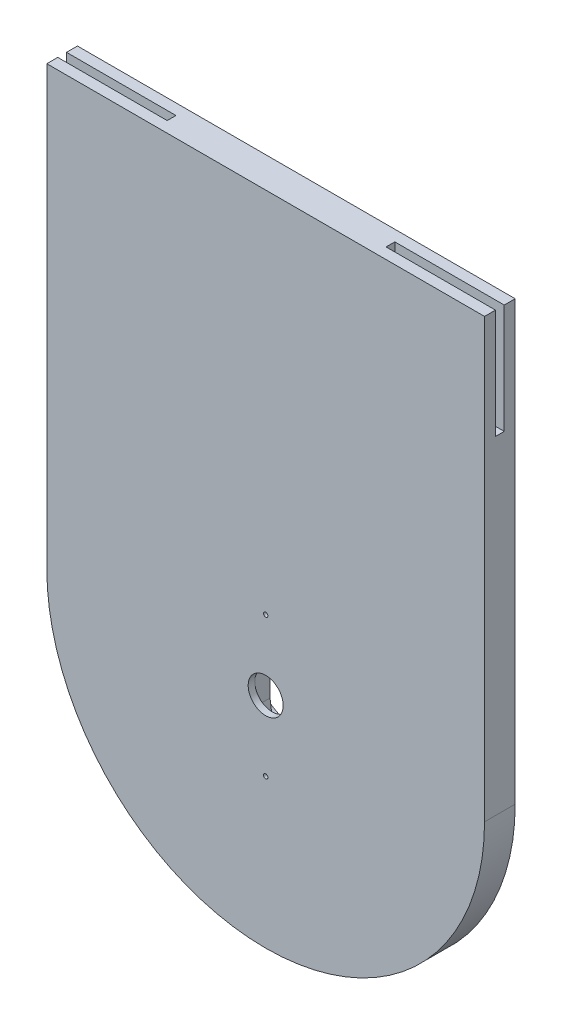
ISO-10303-21;
HEADER;
FILE_DESCRIPTION(('STEP AP214'),'2;1');
FILE_NAME('part.step','',(''),(''),'','','');
FILE_SCHEMA(('AUTOMOTIVE_DESIGN { 1 0 10303 214 1 1 1 1 }'));
ENDSEC;
DATA;
#1=APPLICATION_CONTEXT('core data for automotive mechanical design processes');
#2=APPLICATION_PROTOCOL_DEFINITION('international standard','automotive_design',2000,#1);
#3=PRODUCT_CONTEXT('',#1,'mechanical');
#4=PRODUCT('Part','Part','',(#3));
#5=PRODUCT_RELATED_PRODUCT_CATEGORY('part','',(#4));
#6=PRODUCT_DEFINITION_FORMATION('','',#4);
#7=PRODUCT_DEFINITION_CONTEXT('part definition',#1,'design');
#8=PRODUCT_DEFINITION('design','',#6,#7);
#9=PRODUCT_DEFINITION_SHAPE('','',#8);
#10=(LENGTH_UNIT() NAMED_UNIT(*) SI_UNIT(.MILLI.,.METRE.));
#11=(NAMED_UNIT(*) PLANE_ANGLE_UNIT() SI_UNIT($,.RADIAN.));
#12=(NAMED_UNIT(*) SI_UNIT($,.STERADIAN.) SOLID_ANGLE_UNIT());
#13=UNCERTAINTY_MEASURE_WITH_UNIT(LENGTH_MEASURE(1.E-05),#10,'distance_accuracy_value','');
#14=(GEOMETRIC_REPRESENTATION_CONTEXT(3) GLOBAL_UNCERTAINTY_ASSIGNED_CONTEXT((#13)) GLOBAL_UNIT_ASSIGNED_CONTEXT((#10,
#11,#12)) REPRESENTATION_CONTEXT('',''));
#15=CARTESIAN_POINT('',(0.,0.,0.));
#16=DIRECTION('',(0.,0.,1.));
#17=DIRECTION('',(1.,0.,0.));
#18=AXIS2_PLACEMENT_3D('',#15,#16,#17);
#19=CARTESIAN_POINT('',(0.,0.,0.));
#20=DIRECTION('',(0.,-1.,0.));
#21=DIRECTION('',(0.,0.,-1.));
#22=AXIS2_PLACEMENT_3D('',#19,#20,#21);
#23=PLANE('',#22);
#24=DIRECTION('',(0.,0.,-1.));
#25=VECTOR('',#24,1.);
#26=CARTESIAN_POINT('',(0.,0.,88.));
#27=LINE('',#26,#25);
#28=CARTESIAN_POINT('',(0.,0.,83.5));
#29=VERTEX_POINT('',#28);
#30=CARTESIAN_POINT('',(0.,0.,81.));
#31=VERTEX_POINT('',#30);
#32=EDGE_CURVE('E46',#29,#31,#27,.T.);
#33=ORIENTED_EDGE('',*,*,#32,.F.);
#34=DIRECTION('',(-1.,0.,0.));
#35=VECTOR('',#34,1.);
#36=CARTESIAN_POINT('',(0.,0.,83.5));
#37=LINE('',#36,#35);
#38=CARTESIAN_POINT('',(25.,0.,83.5));
#39=VERTEX_POINT('',#38);
#40=EDGE_CURVE('E225',#39,#29,#37,.T.);
#41=ORIENTED_EDGE('',*,*,#40,.F.);
#42=DIRECTION('',(0.,0.,-1.));
#43=VECTOR('',#42,1.);
#44=CARTESIAN_POINT('',(25.,0.,83.5));
#45=LINE('',#44,#43);
#46=CARTESIAN_POINT('',(25.,0.,85.5));
#47=VERTEX_POINT('',#46);
#48=EDGE_CURVE('E683',#47,#39,#45,.T.);
#49=ORIENTED_EDGE('',*,*,#48,.F.);
#50=DIRECTION('',(1.,0.,0.));
#51=VECTOR('',#50,1.);
#52=CARTESIAN_POINT('',(0.,0.,85.5));
#53=LINE('',#52,#51);
#54=CARTESIAN_POINT('',(0.,0.,85.5));
#55=VERTEX_POINT('',#54);
#56=EDGE_CURVE('E267',#55,#47,#53,.T.);
#57=ORIENTED_EDGE('',*,*,#56,.F.);
#58=CARTESIAN_POINT('',(0.,0.,88.));
#59=VERTEX_POINT('',#58);
#60=EDGE_CURVE('E11',#59,#55,#27,.T.);
#61=ORIENTED_EDGE('',*,*,#60,.F.);
#62=DIRECTION('',(-1.,0.,0.));
#63=VECTOR('',#62,1.);
#64=CARTESIAN_POINT('',(0.,0.,88.));
#65=LINE('',#64,#63);
#66=CARTESIAN_POINT('',(100.,0.,88.));
#67=VERTEX_POINT('',#66);
#68=EDGE_CURVE('E481',#67,#59,#65,.T.);
#69=ORIENTED_EDGE('',*,*,#68,.F.);
#70=DIRECTION('',(0.,0.,1.));
#71=VECTOR('',#70,1.);
#72=CARTESIAN_POINT('',(100.,0.,88.));
#73=LINE('',#72,#71);
#74=CARTESIAN_POINT('',(100.,0.,85.5));
#75=VERTEX_POINT('',#74);
#76=EDGE_CURVE('E489',#75,#67,#73,.T.);
#77=ORIENTED_EDGE('',*,*,#76,.F.);
#78=DIRECTION('',(1.,0.,0.));
#79=VECTOR('',#78,1.);
#80=CARTESIAN_POINT('',(100.,0.,85.5));
#81=LINE('',#80,#79);
#82=CARTESIAN_POINT('',(75.,0.,85.5));
#83=VERTEX_POINT('',#82);
#84=EDGE_CURVE('E243',#83,#75,#81,.T.);
#85=ORIENTED_EDGE('',*,*,#84,.F.);
#86=DIRECTION('',(0.,0.,1.));
#87=VECTOR('',#86,1.);
#88=CARTESIAN_POINT('',(75.,0.,85.5));
#89=LINE('',#88,#87);
#90=CARTESIAN_POINT('',(75.,0.,83.5));
#91=VERTEX_POINT('',#90);
#92=EDGE_CURVE('E257',#91,#83,#89,.T.);
#93=ORIENTED_EDGE('',*,*,#92,.F.);
#94=DIRECTION('',(-1.,0.,0.));
#95=VECTOR('',#94,1.);
#96=CARTESIAN_POINT('',(100.,0.,83.5));
#97=LINE('',#96,#95);
#98=CARTESIAN_POINT('',(100.,0.,83.5));
#99=VERTEX_POINT('',#98);
#100=EDGE_CURVE('E253',#99,#91,#97,.T.);
#101=ORIENTED_EDGE('',*,*,#100,.F.);
#102=CARTESIAN_POINT('',(100.,0.,81.));
#103=VERTEX_POINT('',#102);
#104=EDGE_CURVE('E486',#103,#99,#73,.T.);
#105=ORIENTED_EDGE('',*,*,#104,.F.);
#106=DIRECTION('',(1.,0.,0.));
#107=VECTOR('',#106,1.);
#108=CARTESIAN_POINT('',(0.,0.,81.));
#109=LINE('',#108,#107);
#110=EDGE_CURVE('E415',#31,#103,#109,.T.);
#111=ORIENTED_EDGE('',*,*,#110,.F.);
#112=EDGE_LOOP('',(#33,#41,#49,#57,#61,#69,#77,#85,#93,#101,#105,#111));
#113=FACE_BOUND('',#112,.T.);
#114=ADVANCED_FACE('F38',(#113),#23,.F.);
#115=CARTESIAN_POINT('',(0.,-100.,81.));
#116=DIRECTION('',(0.,0.,1.));
#117=DIRECTION('',(1.,0.,0.));
#118=AXIS2_PLACEMENT_3D('',#115,#116,#117);
#119=PLANE('',#118);
#120=DIRECTION('',(0.135113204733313,-0.990830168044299,0.));
#121=VECTOR('',#120,1.);
#122=CARTESIAN_POINT('',(46.,-105.,81.));
#123=LINE('',#122,#121);
#124=CARTESIAN_POINT('',(46.6006102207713,-109.404474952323,81.));
#125=VERTEX_POINT('',#124);
#126=CARTESIAN_POINT('',(47.5,-116.,81.));
#127=VERTEX_POINT('',#126);
#128=EDGE_CURVE('E352',#125,#127,#123,.T.);
#129=ORIENTED_EDGE('',*,*,#128,.T.);
#130=CARTESIAN_POINT('',(50.,-116.,81.));
#131=DIRECTION('',(0.,0.,1.));
#132=DIRECTION('',(1.,0.,0.));
#133=AXIS2_PLACEMENT_3D('',#130,#131,#132);
#134=CIRCLE('',#133,2.5);
#135=CARTESIAN_POINT('',(52.5,-116.,81.));
#136=VERTEX_POINT('',#135);
#137=EDGE_CURVE('E348',#127,#136,#134,.T.);
#138=ORIENTED_EDGE('',*,*,#137,.T.);
#139=DIRECTION('',(-0.135113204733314,-0.990830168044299,0.));
#140=VECTOR('',#139,1.);
#141=CARTESIAN_POINT('',(54.,-105.,81.));
#142=LINE('',#141,#140);
#143=CARTESIAN_POINT('',(53.3993897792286,-109.404474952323,81.));
#144=VERTEX_POINT('',#143);
#145=EDGE_CURVE('E345',#144,#136,#142,.T.);
#146=ORIENTED_EDGE('',*,*,#145,.F.);
#147=CARTESIAN_POINT('',(50.,-100.,81.));
#148=DIRECTION('',(0.,0.,-1.));
#149=DIRECTION('',(-1.,0.,0.));
#150=AXIS2_PLACEMENT_3D('',#147,#148,#149);
#151=CIRCLE('',#150,10.);
#152=CARTESIAN_POINT('',(53.3993897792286,-90.5955250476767,81.));
#153=VERTEX_POINT('',#152);
#154=EDGE_CURVE('E407',#153,#144,#151,.T.);
#155=ORIENTED_EDGE('',*,*,#154,.F.);
#156=DIRECTION('',(0.135113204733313,-0.990830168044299,0.));
#157=VECTOR('',#156,1.);
#158=CARTESIAN_POINT('',(52.5,-84.,81.));
#159=LINE('',#158,#157);
#160=CARTESIAN_POINT('',(52.5,-84.,81.));
#161=VERTEX_POINT('',#160);
#162=EDGE_CURVE('E342',#161,#153,#159,.T.);
#163=ORIENTED_EDGE('',*,*,#162,.F.);
#164=CARTESIAN_POINT('',(50.,-84.,81.));
#165=DIRECTION('',(0.,0.,-1.));
#166=DIRECTION('',(-1.,0.,0.));
#167=AXIS2_PLACEMENT_3D('',#164,#165,#166);
#168=CIRCLE('',#167,2.5);
#169=CARTESIAN_POINT('',(47.5,-84.,81.));
#170=VERTEX_POINT('',#169);
#171=EDGE_CURVE('E304',#170,#161,#168,.T.);
#172=ORIENTED_EDGE('',*,*,#171,.F.);
#173=DIRECTION('',(-0.135113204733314,-0.990830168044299,0.));
#174=VECTOR('',#173,1.);
#175=CARTESIAN_POINT('',(47.5,-84.,81.));
#176=LINE('',#175,#174);
#177=CARTESIAN_POINT('',(46.6006102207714,-90.5955250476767,81.));
#178=VERTEX_POINT('',#177);
#179=EDGE_CURVE('E310',#170,#178,#176,.T.);
#180=ORIENTED_EDGE('',*,*,#179,.T.);
#181=EDGE_CURVE('E401',#125,#178,#151,.T.);
#182=ORIENTED_EDGE('',*,*,#181,.F.);
#183=EDGE_LOOP('',(#129,#138,#146,#155,#163,#172,#180,#182));
#184=FACE_BOUND('',#183,.T.);
#185=CARTESIAN_POINT('',(50.,-100.,81.));
#186=DIRECTION('',(0.,0.,-1.));
#187=DIRECTION('',(-1.,0.,0.));
#188=AXIS2_PLACEMENT_3D('',#185,#186,#187);
#189=CIRCLE('',#188,32.);
#190=CARTESIAN_POINT('',(18.,-100.,81.));
#191=VERTEX_POINT('',#190);
#192=EDGE_CURVE('E276',#191,#191,#189,.T.);
#193=ORIENTED_EDGE('',*,*,#192,.T.);
#194=EDGE_LOOP('',(#193));
#195=FACE_BOUND('',#194,.T.);
#196=ADVANCED_FACE('F534',(#184,#195),#119,.F.);
#197=CARTESIAN_POINT('',(50.,-84.,86.5));
#198=DIRECTION('',(0.,0.,-1.));
#199=DIRECTION('',(-1.,0.,0.));
#200=AXIS2_PLACEMENT_3D('',#197,#198,#199);
#201=PLANE('',#200);
#202=CARTESIAN_POINT('',(50.,-100.,86.5));
#203=DIRECTION('',(0.,0.,-1.));
#204=DIRECTION('',(-1.,0.,0.));
#205=AXIS2_PLACEMENT_3D('',#202,#203,#204);
#206=CIRCLE('',#205,4.00000000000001);
#207=CARTESIAN_POINT('',(46.,-100.,86.5));
#208=VERTEX_POINT('',#207);
#209=CARTESIAN_POINT('',(54.,-100.,86.5));
#210=VERTEX_POINT('',#209);
#211=EDGE_CURVE('E280',#208,#210,#206,.T.);
#212=ORIENTED_EDGE('',*,*,#211,.F.);
#213=DIRECTION('',(0.,1.,0.));
#214=VECTOR('',#213,1.);
#215=CARTESIAN_POINT('',(46.,-105.,86.5));
#216=LINE('',#215,#214);
#217=CARTESIAN_POINT('',(46.,-95.,86.5));
#218=VERTEX_POINT('',#217);
#219=EDGE_CURVE('E329',#208,#218,#216,.T.);
#220=ORIENTED_EDGE('',*,*,#219,.T.);
#221=DIRECTION('',(-0.135113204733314,-0.990830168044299,0.));
#222=VECTOR('',#221,1.);
#223=CARTESIAN_POINT('',(47.5,-84.,86.5));
#224=LINE('',#223,#222);
#225=CARTESIAN_POINT('',(47.5,-84.,86.5));
#226=VERTEX_POINT('',#225);
#227=EDGE_CURVE('E334',#226,#218,#224,.T.);
#228=ORIENTED_EDGE('',*,*,#227,.F.);
#229=CARTESIAN_POINT('',(50.,-84.,86.5));
#230=DIRECTION('',(0.,0.,-1.));
#231=DIRECTION('',(-1.,0.,0.));
#232=AXIS2_PLACEMENT_3D('',#229,#230,#231);
#233=CIRCLE('',#232,2.5);
#234=CARTESIAN_POINT('',(52.5,-84.,86.5));
#235=VERTEX_POINT('',#234);
#236=EDGE_CURVE('E305',#226,#235,#233,.T.);
#237=ORIENTED_EDGE('',*,*,#236,.T.);
#238=DIRECTION('',(0.135113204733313,-0.990830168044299,0.));
#239=VECTOR('',#238,1.);
#240=CARTESIAN_POINT('',(52.5,-84.,86.5));
#241=LINE('',#240,#239);
#242=CARTESIAN_POINT('',(54.,-95.,86.5));
#243=VERTEX_POINT('',#242);
#244=EDGE_CURVE('E309',#235,#243,#241,.T.);
#245=ORIENTED_EDGE('',*,*,#244,.T.);
#246=DIRECTION('',(0.,1.,0.));
#247=VECTOR('',#246,1.);
#248=CARTESIAN_POINT('',(54.,-105.,86.5));
#249=LINE('',#248,#247);
#250=EDGE_CURVE('E314',#210,#243,#249,.T.);
#251=ORIENTED_EDGE('',*,*,#250,.F.);
#252=EDGE_LOOP('',(#212,#220,#228,#237,#245,#251));
#253=FACE_BOUND('',#252,.T.);
#254=CARTESIAN_POINT('',(50.,-84.,86.5));
#255=DIRECTION('',(0.,0.,-1.));
#256=DIRECTION('',(-1.,0.,0.));
#257=AXIS2_PLACEMENT_3D('',#254,#255,#256);
#258=CIRCLE('',#257,0.499999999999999);
#259=CARTESIAN_POINT('',(49.5,-84.,86.5));
#260=VERTEX_POINT('',#259);
#261=EDGE_CURVE('E289',#260,#260,#258,.T.);
#262=ORIENTED_EDGE('',*,*,#261,.F.);
#263=EDGE_LOOP('',(#262));
#264=FACE_BOUND('',#263,.T.);
#265=ADVANCED_FACE('F541',(#253,#264),#201,.T.);
#266=CARTESIAN_POINT('',(50.,-100.,81.));
#267=DIRECTION('',(0.,0.,1.));
#268=DIRECTION('',(1.,0.,0.));
#269=AXIS2_PLACEMENT_3D('',#266,#267,#268);
#270=CIRCLE('',#269,35.);
#271=CARTESIAN_POINT('',(85.,-100.,81.));
#272=VERTEX_POINT('',#271);
#273=EDGE_CURVE('E469',#272,#272,#270,.F.);
#274=ORIENTED_EDGE('',*,*,#273,.F.);
#275=EDGE_LOOP('',(#274));
#276=FACE_BOUND('',#275,.T.);
#277=DIRECTION('',(0.,1.,0.));
#278=VECTOR('',#277,1.);
#279=CARTESIAN_POINT('',(0.,-100.,81.));
#280=LINE('',#279,#278);
#281=CARTESIAN_POINT('',(0.,-100.,81.));
#282=VERTEX_POINT('',#281);
#283=EDGE_CURVE('E434',#282,#31,#280,.T.);
#284=ORIENTED_EDGE('',*,*,#283,.T.);
#285=ORIENTED_EDGE('',*,*,#110,.T.);
#286=DIRECTION('',(0.,1.,0.));
#287=VECTOR('',#286,1.);
#288=CARTESIAN_POINT('',(100.,-100.,81.));
#289=LINE('',#288,#287);
#290=CARTESIAN_POINT('',(100.,-100.,81.));
#291=VERTEX_POINT('',#290);
#292=EDGE_CURVE('E428',#291,#103,#289,.T.);
#293=ORIENTED_EDGE('',*,*,#292,.F.);
#294=CARTESIAN_POINT('',(50.,-100.,81.));
#295=DIRECTION('',(0.,0.,-1.));
#296=DIRECTION('',(1.,0.,0.));
#297=AXIS2_PLACEMENT_3D('',#294,#295,#296);
#298=CIRCLE('',#297,50.);
#299=EDGE_CURVE('E416',#291,#282,#298,.T.);
#300=ORIENTED_EDGE('',*,*,#299,.T.);
#301=EDGE_LOOP('',(#284,#285,#293,#300));
#302=FACE_BOUND('',#301,.T.);
#303=ADVANCED_FACE('F509',(#276,#302),#119,.F.);
#304=CARTESIAN_POINT('',(50.,-100.,83.));
#305=DIRECTION('',(0.,0.,-1.));
#306=DIRECTION('',(-1.,0.,0.));
#307=AXIS2_PLACEMENT_3D('',#304,#305,#306);
#308=CYLINDRICAL_SURFACE('',#307,10.);
#309=DIRECTION('',(0.,0.,-1.));
#310=VECTOR('',#309,1.);
#311=CARTESIAN_POINT('',(46.6006102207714,-90.5955250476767,83.));
#312=LINE('',#311,#310);
#313=CARTESIAN_POINT('',(46.6006102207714,-90.5955250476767,83.));
#314=VERTEX_POINT('',#313);
#315=EDGE_CURVE('E398',#314,#178,#312,.T.);
#316=ORIENTED_EDGE('',*,*,#315,.F.);
#317=CARTESIAN_POINT('',(50.,-100.,83.));
#318=DIRECTION('',(0.,0.,-1.));
#319=DIRECTION('',(-1.,0.,0.));
#320=AXIS2_PLACEMENT_3D('',#317,#318,#319);
#321=CIRCLE('',#320,10.);
#322=CARTESIAN_POINT('',(46.6006102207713,-109.404474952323,83.));
#323=VERTEX_POINT('',#322);
#324=EDGE_CURVE('E402',#323,#314,#321,.T.);
#325=ORIENTED_EDGE('',*,*,#324,.F.);
#326=DIRECTION('',(0.,0.,-1.));
#327=VECTOR('',#326,1.);
#328=CARTESIAN_POINT('',(46.6006102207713,-109.404474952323,83.));
#329=LINE('',#328,#327);
#330=EDGE_CURVE('E395',#125,#323,#329,.F.);
#331=ORIENTED_EDGE('',*,*,#330,.F.);
#332=ORIENTED_EDGE('',*,*,#181,.T.);
#333=EDGE_LOOP('',(#316,#325,#331,#332));
#334=FACE_BOUND('',#333,.T.);
#335=ADVANCED_FACE('F566',(#334),#308,.F.);
#336=CARTESIAN_POINT('',(50.,-100.,83.));
#337=DIRECTION('',(0.,0.,-1.));
#338=DIRECTION('',(-1.,0.,0.));
#339=AXIS2_PLACEMENT_3D('',#336,#337,#338);
#340=PLANE('',#339);
#341=ORIENTED_EDGE('',*,*,#324,.T.);
#342=DIRECTION('',(-0.135113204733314,-0.990830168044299,0.));
#343=VECTOR('',#342,1.);
#344=CARTESIAN_POINT('',(45.4036511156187,-99.3732251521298,83.));
#345=LINE('',#344,#343);
#346=CARTESIAN_POINT('',(46.,-95.,83.));
#347=VERTEX_POINT('',#346);
#348=EDGE_CURVE('E462',#314,#347,#345,.T.);
#349=ORIENTED_EDGE('',*,*,#348,.T.);
#350=DIRECTION('',(0.,1.,0.));
#351=VECTOR('',#350,1.);
#352=CARTESIAN_POINT('',(46.,-100.,83.));
#353=LINE('',#352,#351);
#354=CARTESIAN_POINT('',(46.,-105.,83.));
#355=VERTEX_POINT('',#354);
#356=EDGE_CURVE('E459',#355,#347,#353,.T.);
#357=ORIENTED_EDGE('',*,*,#356,.F.);
#358=DIRECTION('',(0.135113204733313,-0.990830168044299,0.));
#359=VECTOR('',#358,1.);
#360=CARTESIAN_POINT('',(45.4036511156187,-100.62677484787,83.));
#361=LINE('',#360,#359);
#362=EDGE_CURVE('E455',#355,#323,#361,.T.);
#363=ORIENTED_EDGE('',*,*,#362,.T.);
#364=EDGE_LOOP('',(#341,#349,#357,#363));
#365=FACE_BOUND('',#364,.T.);
#366=ADVANCED_FACE('F559',(#365),#340,.T.);
#367=CARTESIAN_POINT('',(0.,0.,88.));
#368=DIRECTION('',(1.,0.,0.));
#369=DIRECTION('',(0.,0.,-1.));
#370=AXIS2_PLACEMENT_3D('',#367,#368,#369);
#371=PLANE('',#370);
#372=DIRECTION('',(0.,0.,1.));
#373=VECTOR('',#372,1.);
#374=CARTESIAN_POINT('',(0.,-25.,83.5));
#375=LINE('',#374,#373);
#376=CARTESIAN_POINT('',(0.,-25.,83.5));
#377=VERTEX_POINT('',#376);
#378=CARTESIAN_POINT('',(0.,-25.,85.5));
#379=VERTEX_POINT('',#378);
#380=EDGE_CURVE('E218',#377,#379,#375,.T.);
#381=ORIENTED_EDGE('',*,*,#380,.F.);
#382=DIRECTION('',(0.,1.,0.));
#383=VECTOR('',#382,1.);
#384=CARTESIAN_POINT('',(0.,-25.,83.5));
#385=LINE('',#384,#383);
#386=EDGE_CURVE('E485',#377,#29,#385,.T.);
#387=ORIENTED_EDGE('',*,*,#386,.T.);
#388=ORIENTED_EDGE('',*,*,#32,.T.);
#389=ORIENTED_EDGE('',*,*,#283,.F.);
#390=DIRECTION('',(0.,0.,-1.));
#391=VECTOR('',#390,1.);
#392=CARTESIAN_POINT('',(0.,-100.,88.));
#393=LINE('',#392,#391);
#394=CARTESIAN_POINT('',(0.,-100.,88.));
#395=VERTEX_POINT('',#394);
#396=EDGE_CURVE('E420',#395,#282,#393,.T.);
#397=ORIENTED_EDGE('',*,*,#396,.F.);
#398=DIRECTION('',(0.,-1.,0.));
#399=VECTOR('',#398,1.);
#400=CARTESIAN_POINT('',(0.,0.,88.));
#401=LINE('',#400,#399);
#402=EDGE_CURVE('E438',#59,#395,#401,.T.);
#403=ORIENTED_EDGE('',*,*,#402,.F.);
#404=ORIENTED_EDGE('',*,*,#60,.T.);
#405=DIRECTION('',(0.,1.,0.));
#406=VECTOR('',#405,1.);
#407=CARTESIAN_POINT('',(0.,-25.,85.5));
#408=LINE('',#407,#406);
#409=EDGE_CURVE('E212',#379,#55,#408,.T.);
#410=ORIENTED_EDGE('',*,*,#409,.F.);
#411=EDGE_LOOP('',(#381,#387,#388,#389,#397,#403,#404,#410));
#412=FACE_BOUND('',#411,.T.);
#413=ADVANCED_FACE('F227',(#412),#371,.F.);
#414=CARTESIAN_POINT('',(100.,0.,88.));
#415=DIRECTION('',(-1.,0.,0.));
#416=DIRECTION('',(0.,0.,1.));
#417=AXIS2_PLACEMENT_3D('',#414,#415,#416);
#418=PLANE('',#417);
#419=DIRECTION('',(0.,0.,-1.));
#420=VECTOR('',#419,1.);
#421=CARTESIAN_POINT('',(100.,-25.,85.5));
#422=LINE('',#421,#420);
#423=CARTESIAN_POINT('',(100.,-25.,85.5));
#424=VERTEX_POINT('',#423);
#425=CARTESIAN_POINT('',(100.,-25.,83.5));
#426=VERTEX_POINT('',#425);
#427=EDGE_CURVE('E239',#424,#426,#422,.T.);
#428=ORIENTED_EDGE('',*,*,#427,.F.);
#429=DIRECTION('',(0.,1.,0.));
#430=VECTOR('',#429,1.);
#431=CARTESIAN_POINT('',(100.,-25.,85.5));
#432=LINE('',#431,#430);
#433=EDGE_CURVE('E263',#424,#75,#432,.T.);
#434=ORIENTED_EDGE('',*,*,#433,.T.);
#435=ORIENTED_EDGE('',*,*,#76,.T.);
#436=DIRECTION('',(0.,1.,0.));
#437=VECTOR('',#436,1.);
#438=CARTESIAN_POINT('',(100.,0.,88.));
#439=LINE('',#438,#437);
#440=CARTESIAN_POINT('',(100.,-100.,88.));
#441=VERTEX_POINT('',#440);
#442=EDGE_CURVE('E441',#441,#67,#439,.T.);
#443=ORIENTED_EDGE('',*,*,#442,.F.);
#444=DIRECTION('',(0.,0.,1.));
#445=VECTOR('',#444,1.);
#446=CARTESIAN_POINT('',(100.,-100.,88.));
#447=LINE('',#446,#445);
#448=EDGE_CURVE('E424',#291,#441,#447,.T.);
#449=ORIENTED_EDGE('',*,*,#448,.F.);
#450=ORIENTED_EDGE('',*,*,#292,.T.);
#451=ORIENTED_EDGE('',*,*,#104,.T.);
#452=DIRECTION('',(0.,1.,0.));
#453=VECTOR('',#452,1.);
#454=CARTESIAN_POINT('',(100.,-25.,83.5));
#455=LINE('',#454,#453);
#456=EDGE_CURVE('E252',#426,#99,#455,.T.);
#457=ORIENTED_EDGE('',*,*,#456,.F.);
#458=EDGE_LOOP('',(#428,#434,#435,#443,#449,#450,#451,#457));
#459=FACE_BOUND('',#458,.T.);
#460=ADVANCED_FACE('F497',(#459),#418,.F.);
#461=CARTESIAN_POINT('',(0.,0.,88.));
#462=DIRECTION('',(0.,0.,-1.));
#463=DIRECTION('',(-1.,0.,0.));
#464=AXIS2_PLACEMENT_3D('',#461,#462,#463);
#465=PLANE('',#464);
#466=CARTESIAN_POINT('',(50.,-100.,88.));
#467=DIRECTION('',(0.,0.,-1.));
#468=DIRECTION('',(-1.,0.,0.));
#469=AXIS2_PLACEMENT_3D('',#466,#467,#468);
#470=CIRCLE('',#469,4.00000000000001);
#471=CARTESIAN_POINT('',(46.,-100.,88.));
#472=VERTEX_POINT('',#471);
#473=EDGE_CURVE('E284',#472,#472,#470,.T.);
#474=ORIENTED_EDGE('',*,*,#473,.T.);
#475=EDGE_LOOP('',(#474));
#476=FACE_BOUND('',#475,.T.);
#477=CARTESIAN_POINT('',(50.,-84.,88.));
#478=DIRECTION('',(0.,0.,-1.));
#479=DIRECTION('',(-1.,0.,0.));
#480=AXIS2_PLACEMENT_3D('',#477,#478,#479);
#481=CIRCLE('',#480,0.499999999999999);
#482=CARTESIAN_POINT('',(49.5,-84.,88.));
#483=VERTEX_POINT('',#482);
#484=EDGE_CURVE('E300',#483,#483,#481,.T.);
#485=ORIENTED_EDGE('',*,*,#484,.T.);
#486=EDGE_LOOP('',(#485));
#487=FACE_BOUND('',#486,.T.);
#488=CARTESIAN_POINT('',(50.,-116.,88.));
#489=DIRECTION('',(0.,0.,-1.));
#490=DIRECTION('',(-1.,0.,0.));
#491=AXIS2_PLACEMENT_3D('',#488,#489,#490);
#492=CIRCLE('',#491,0.499999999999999);
#493=CARTESIAN_POINT('',(49.5,-116.,88.));
#494=VERTEX_POINT('',#493);
#495=EDGE_CURVE('E293',#494,#494,#492,.T.);
#496=ORIENTED_EDGE('',*,*,#495,.T.);
#497=EDGE_LOOP('',(#496));
#498=FACE_BOUND('',#497,.T.);
#499=ORIENTED_EDGE('',*,*,#442,.T.);
#500=ORIENTED_EDGE('',*,*,#68,.T.);
#501=ORIENTED_EDGE('',*,*,#402,.T.);
#502=CARTESIAN_POINT('',(50.,-100.,88.));
#503=DIRECTION('',(0.,0.,-1.));
#504=DIRECTION('',(1.,0.,0.));
#505=AXIS2_PLACEMENT_3D('',#502,#503,#504);
#506=CIRCLE('',#505,50.);
#507=EDGE_CURVE('E411',#441,#395,#506,.T.);
#508=ORIENTED_EDGE('',*,*,#507,.F.);
#509=EDGE_LOOP('',(#499,#500,#501,#508));
#510=FACE_BOUND('',#509,.T.);
#511=ADVANCED_FACE('F502',(#476,#487,#498,#510),#465,.F.);
#512=CARTESIAN_POINT('',(50.,-100.,88.));
#513=DIRECTION('',(0.,0.,-1.));
#514=DIRECTION('',(-1.,0.,0.));
#515=AXIS2_PLACEMENT_3D('',#512,#513,#514);
#516=CYLINDRICAL_SURFACE('',#515,50.);
#517=ORIENTED_EDGE('',*,*,#299,.F.);
#518=ORIENTED_EDGE('',*,*,#448,.T.);
#519=ORIENTED_EDGE('',*,*,#507,.T.);
#520=ORIENTED_EDGE('',*,*,#396,.T.);
#521=EDGE_LOOP('',(#517,#518,#519,#520));
#522=FACE_BOUND('',#521,.T.);
#523=ADVANCED_FACE('F506',(#522),#516,.T.);
#524=ORIENTED_EDGE('',*,*,#154,.T.);
#525=DIRECTION('',(0.,0.,-1.));
#526=VECTOR('',#525,1.);
#527=CARTESIAN_POINT('',(53.3993897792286,-109.404474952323,83.));
#528=LINE('',#527,#526);
#529=CARTESIAN_POINT('',(53.3993897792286,-109.404474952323,83.));
#530=VERTEX_POINT('',#529);
#531=EDGE_CURVE('E391',#144,#530,#528,.F.);
#532=ORIENTED_EDGE('',*,*,#531,.T.);
#533=CARTESIAN_POINT('',(53.3993897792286,-90.5955250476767,83.));
#534=VERTEX_POINT('',#533);
#535=EDGE_CURVE('E406',#534,#530,#321,.T.);
#536=ORIENTED_EDGE('',*,*,#535,.F.);
#537=DIRECTION('',(0.,0.,-1.));
#538=VECTOR('',#537,1.);
#539=CARTESIAN_POINT('',(53.3993897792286,-90.5955250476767,83.));
#540=LINE('',#539,#538);
#541=EDGE_CURVE('E362',#534,#153,#540,.T.);
#542=ORIENTED_EDGE('',*,*,#541,.T.);
#543=EDGE_LOOP('',(#524,#532,#536,#542));
#544=FACE_BOUND('',#543,.T.);
#545=ADVANCED_FACE('F570',(#544),#308,.F.);
#546=DIRECTION('',(-0.135113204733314,-0.990830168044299,0.));
#547=VECTOR('',#546,1.);
#548=CARTESIAN_POINT('',(54.5963488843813,-100.62677484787,83.));
#549=LINE('',#548,#547);
#550=CARTESIAN_POINT('',(54.,-105.,83.));
#551=VERTEX_POINT('',#550);
#552=EDGE_CURVE('E452',#551,#530,#549,.T.);
#553=ORIENTED_EDGE('',*,*,#552,.F.);
#554=DIRECTION('',(0.,1.,0.));
#555=VECTOR('',#554,1.);
#556=CARTESIAN_POINT('',(54.,-100.,83.));
#557=LINE('',#556,#555);
#558=CARTESIAN_POINT('',(54.,-95.,83.));
#559=VERTEX_POINT('',#558);
#560=EDGE_CURVE('E448',#551,#559,#557,.T.);
#561=ORIENTED_EDGE('',*,*,#560,.T.);
#562=DIRECTION('',(0.135113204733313,-0.990830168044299,0.));
#563=VECTOR('',#562,1.);
#564=CARTESIAN_POINT('',(54.5963488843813,-99.3732251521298,83.));
#565=LINE('',#564,#563);
#566=EDGE_CURVE('E445',#534,#559,#565,.T.);
#567=ORIENTED_EDGE('',*,*,#566,.F.);
#568=ORIENTED_EDGE('',*,*,#535,.T.);
#569=EDGE_LOOP('',(#553,#561,#567,#568));
#570=FACE_BOUND('',#569,.T.);
#571=ADVANCED_FACE('F573',(#570),#340,.T.);
#572=CARTESIAN_POINT('',(47.5,-84.,86.5));
#573=DIRECTION('',(0.990830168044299,-0.135113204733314,0.));
#574=DIRECTION('',(0.135113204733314,0.990830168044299,0.));
#575=AXIS2_PLACEMENT_3D('',#572,#573,#574);
#576=PLANE('',#575);
#577=ORIENTED_EDGE('',*,*,#315,.T.);
#578=ORIENTED_EDGE('',*,*,#179,.F.);
#579=DIRECTION('',(0.,0.,-1.));
#580=VECTOR('',#579,1.);
#581=CARTESIAN_POINT('',(47.5,-84.,86.5));
#582=LINE('',#581,#580);
#583=EDGE_CURVE('E359',#226,#170,#582,.T.);
#584=ORIENTED_EDGE('',*,*,#583,.F.);
#585=ORIENTED_EDGE('',*,*,#227,.T.);
#586=DIRECTION('',(0.,0.,-1.));
#587=VECTOR('',#586,1.);
#588=CARTESIAN_POINT('',(46.,-95.,86.5));
#589=LINE('',#588,#587);
#590=EDGE_CURVE('E363',#218,#347,#589,.T.);
#591=ORIENTED_EDGE('',*,*,#590,.T.);
#592=ORIENTED_EDGE('',*,*,#348,.F.);
#593=EDGE_LOOP('',(#577,#578,#584,#585,#591,#592));
#594=FACE_BOUND('',#593,.T.);
#595=ADVANCED_FACE('F577',(#594),#576,.T.);
#596=CARTESIAN_POINT('',(46.,-105.,86.5));
#597=DIRECTION('',(0.990830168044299,0.135113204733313,0.));
#598=DIRECTION('',(-0.135113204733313,0.990830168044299,0.));
#599=AXIS2_PLACEMENT_3D('',#596,#597,#598);
#600=PLANE('',#599);
#601=ORIENTED_EDGE('',*,*,#330,.T.);
#602=ORIENTED_EDGE('',*,*,#362,.F.);
#603=DIRECTION('',(0.,0.,-1.));
#604=VECTOR('',#603,1.);
#605=CARTESIAN_POINT('',(46.,-105.,86.5));
#606=LINE('',#605,#604);
#607=CARTESIAN_POINT('',(46.,-105.,86.5));
#608=VERTEX_POINT('',#607);
#609=EDGE_CURVE('E367',#608,#355,#606,.T.);
#610=ORIENTED_EDGE('',*,*,#609,.F.);
#611=DIRECTION('',(0.135113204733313,-0.990830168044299,0.));
#612=VECTOR('',#611,1.);
#613=CARTESIAN_POINT('',(46.,-105.,86.5));
#614=LINE('',#613,#612);
#615=CARTESIAN_POINT('',(47.5,-116.,86.5));
#616=VERTEX_POINT('',#615);
#617=EDGE_CURVE('E326',#608,#616,#614,.T.);
#618=ORIENTED_EDGE('',*,*,#617,.T.);
#619=DIRECTION('',(0.,0.,-1.));
#620=VECTOR('',#619,1.);
#621=CARTESIAN_POINT('',(47.5,-116.,86.5));
#622=LINE('',#621,#620);
#623=EDGE_CURVE('E371',#616,#127,#622,.T.);
#624=ORIENTED_EDGE('',*,*,#623,.T.);
#625=ORIENTED_EDGE('',*,*,#128,.F.);
#626=EDGE_LOOP('',(#601,#602,#610,#618,#624,#625));
#627=FACE_BOUND('',#626,.T.);
#628=ADVANCED_FACE('F597',(#627),#600,.T.);
#629=CARTESIAN_POINT('',(54.,-105.,86.5));
#630=DIRECTION('',(0.990830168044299,-0.135113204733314,0.));
#631=DIRECTION('',(0.135113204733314,0.990830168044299,0.));
#632=AXIS2_PLACEMENT_3D('',#629,#630,#631);
#633=PLANE('',#632);
#634=ORIENTED_EDGE('',*,*,#145,.T.);
#635=DIRECTION('',(0.,0.,-1.));
#636=VECTOR('',#635,1.);
#637=CARTESIAN_POINT('',(52.5,-116.,86.5));
#638=LINE('',#637,#636);
#639=CARTESIAN_POINT('',(52.5,-116.,86.5));
#640=VERTEX_POINT('',#639);
#641=EDGE_CURVE('E374',#640,#136,#638,.T.);
#642=ORIENTED_EDGE('',*,*,#641,.F.);
#643=DIRECTION('',(-0.135113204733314,-0.990830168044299,0.));
#644=VECTOR('',#643,1.);
#645=CARTESIAN_POINT('',(54.,-105.,86.5));
#646=LINE('',#645,#644);
#647=CARTESIAN_POINT('',(54.,-105.,86.5));
#648=VERTEX_POINT('',#647);
#649=EDGE_CURVE('E319',#648,#640,#646,.T.);
#650=ORIENTED_EDGE('',*,*,#649,.F.);
#651=DIRECTION('',(0.,0.,-1.));
#652=VECTOR('',#651,1.);
#653=CARTESIAN_POINT('',(54.,-105.,86.5));
#654=LINE('',#653,#652);
#655=EDGE_CURVE('E378',#648,#551,#654,.T.);
#656=ORIENTED_EDGE('',*,*,#655,.T.);
#657=ORIENTED_EDGE('',*,*,#552,.T.);
#658=ORIENTED_EDGE('',*,*,#531,.F.);
#659=EDGE_LOOP('',(#634,#642,#650,#656,#657,#658));
#660=FACE_BOUND('',#659,.T.);
#661=ADVANCED_FACE('F587',(#660),#633,.F.);
#662=CARTESIAN_POINT('',(52.5,-84.,86.5));
#663=DIRECTION('',(0.990830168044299,0.135113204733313,0.));
#664=DIRECTION('',(-0.135113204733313,0.990830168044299,0.));
#665=AXIS2_PLACEMENT_3D('',#662,#663,#664);
#666=PLANE('',#665);
#667=ORIENTED_EDGE('',*,*,#566,.T.);
#668=DIRECTION('',(0.,0.,-1.));
#669=VECTOR('',#668,1.);
#670=CARTESIAN_POINT('',(54.,-95.,86.5));
#671=LINE('',#670,#669);
#672=EDGE_CURVE('E382',#243,#559,#671,.T.);
#673=ORIENTED_EDGE('',*,*,#672,.F.);
#674=ORIENTED_EDGE('',*,*,#244,.F.);
#675=DIRECTION('',(0.,0.,-1.));
#676=VECTOR('',#675,1.);
#677=CARTESIAN_POINT('',(52.5,-84.,86.5));
#678=LINE('',#677,#676);
#679=EDGE_CURVE('E338',#235,#161,#678,.T.);
#680=ORIENTED_EDGE('',*,*,#679,.T.);
#681=ORIENTED_EDGE('',*,*,#162,.T.);
#682=ORIENTED_EDGE('',*,*,#541,.F.);
#683=EDGE_LOOP('',(#667,#673,#674,#680,#681,#682));
#684=FACE_BOUND('',#683,.T.);
#685=ADVANCED_FACE('F583',(#684),#666,.F.);
#686=CARTESIAN_POINT('',(50.,-84.,86.5));
#687=DIRECTION('',(0.,0.,-1.));
#688=DIRECTION('',(-1.,0.,0.));
#689=AXIS2_PLACEMENT_3D('',#686,#687,#688);
#690=CYLINDRICAL_SURFACE('',#689,2.5);
#691=ORIENTED_EDGE('',*,*,#171,.T.);
#692=ORIENTED_EDGE('',*,*,#679,.F.);
#693=ORIENTED_EDGE('',*,*,#236,.F.);
#694=ORIENTED_EDGE('',*,*,#583,.T.);
#695=EDGE_LOOP('',(#691,#692,#693,#694));
#696=FACE_BOUND('',#695,.T.);
#697=ADVANCED_FACE('F579',(#696),#690,.F.);
#698=CARTESIAN_POINT('',(46.,-105.,86.5));
#699=DIRECTION('',(-1.,0.,0.));
#700=DIRECTION('',(0.,0.,1.));
#701=AXIS2_PLACEMENT_3D('',#698,#699,#700);
#702=PLANE('',#701);
#703=ORIENTED_EDGE('',*,*,#356,.T.);
#704=ORIENTED_EDGE('',*,*,#590,.F.);
#705=ORIENTED_EDGE('',*,*,#219,.F.);
#706=EDGE_CURVE('E330',#608,#208,#216,.T.);
#707=ORIENTED_EDGE('',*,*,#706,.F.);
#708=ORIENTED_EDGE('',*,*,#609,.T.);
#709=EDGE_LOOP('',(#703,#704,#705,#707,#708));
#710=FACE_BOUND('',#709,.T.);
#711=ADVANCED_FACE('F582',(#710),#702,.F.);
#712=CARTESIAN_POINT('',(50.,-116.,86.5));
#713=DIRECTION('',(0.,0.,-1.));
#714=DIRECTION('',(-1.,0.,0.));
#715=AXIS2_PLACEMENT_3D('',#712,#713,#714);
#716=CYLINDRICAL_SURFACE('',#715,2.5);
#717=ORIENTED_EDGE('',*,*,#137,.F.);
#718=ORIENTED_EDGE('',*,*,#623,.F.);
#719=CARTESIAN_POINT('',(50.,-116.,86.5));
#720=DIRECTION('',(0.,0.,1.));
#721=DIRECTION('',(1.,0.,0.));
#722=AXIS2_PLACEMENT_3D('',#719,#720,#721);
#723=CIRCLE('',#722,2.5);
#724=EDGE_CURVE('E323',#616,#640,#723,.T.);
#725=ORIENTED_EDGE('',*,*,#724,.T.);
#726=ORIENTED_EDGE('',*,*,#641,.T.);
#727=EDGE_LOOP('',(#717,#718,#725,#726));
#728=FACE_BOUND('',#727,.T.);
#729=ADVANCED_FACE('F593',(#728),#716,.F.);
#730=CARTESIAN_POINT('',(54.,-105.,86.5));
#731=DIRECTION('',(-1.,0.,0.));
#732=DIRECTION('',(0.,0.,1.));
#733=AXIS2_PLACEMENT_3D('',#730,#731,#732);
#734=PLANE('',#733);
#735=ORIENTED_EDGE('',*,*,#655,.F.);
#736=EDGE_CURVE('E315',#648,#210,#249,.T.);
#737=ORIENTED_EDGE('',*,*,#736,.T.);
#738=ORIENTED_EDGE('',*,*,#250,.T.);
#739=ORIENTED_EDGE('',*,*,#672,.T.);
#740=ORIENTED_EDGE('',*,*,#560,.F.);
#741=EDGE_LOOP('',(#735,#737,#738,#739,#740));
#742=FACE_BOUND('',#741,.T.);
#743=ADVANCED_FACE('F589',(#742),#734,.T.);
#744=CARTESIAN_POINT('',(50.,-100.,86.5));
#745=DIRECTION('',(0.,0.,-1.));
#746=DIRECTION('',(-1.,0.,0.));
#747=AXIS2_PLACEMENT_3D('',#744,#745,#746);
#748=CIRCLE('',#747,4.00000000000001);
#749=EDGE_CURVE('E466',#210,#208,#748,.T.);
#750=ORIENTED_EDGE('',*,*,#749,.F.);
#751=ORIENTED_EDGE('',*,*,#736,.F.);
#752=ORIENTED_EDGE('',*,*,#649,.T.);
#753=ORIENTED_EDGE('',*,*,#724,.F.);
#754=ORIENTED_EDGE('',*,*,#617,.F.);
#755=ORIENTED_EDGE('',*,*,#706,.T.);
#756=EDGE_LOOP('',(#750,#751,#752,#753,#754,#755));
#757=FACE_BOUND('',#756,.T.);
#758=CARTESIAN_POINT('',(50.,-116.,86.5));
#759=DIRECTION('',(0.,0.,-1.));
#760=DIRECTION('',(-1.,0.,0.));
#761=AXIS2_PLACEMENT_3D('',#758,#759,#760);
#762=CIRCLE('',#761,0.499999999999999);
#763=CARTESIAN_POINT('',(49.5,-116.,86.5));
#764=VERTEX_POINT('',#763);
#765=EDGE_CURVE('E288',#764,#764,#762,.T.);
#766=ORIENTED_EDGE('',*,*,#765,.F.);
#767=EDGE_LOOP('',(#766));
#768=FACE_BOUND('',#767,.T.);
#769=ADVANCED_FACE('F592',(#757,#768),#201,.T.);
#770=CARTESIAN_POINT('',(50.,-116.,92.));
#771=DIRECTION('',(0.,0.,-1.));
#772=DIRECTION('',(-1.,0.,0.));
#773=AXIS2_PLACEMENT_3D('',#770,#771,#772);
#774=CYLINDRICAL_SURFACE('',#773,0.499999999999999);
#775=ORIENTED_EDGE('',*,*,#765,.T.);
#776=EDGE_LOOP('',(#775));
#777=FACE_BOUND('',#776,.T.);
#778=ORIENTED_EDGE('',*,*,#495,.F.);
#779=EDGE_LOOP('',(#778));
#780=FACE_BOUND('',#779,.T.);
#781=ADVANCED_FACE('F613',(#777,#780),#774,.F.);
#782=CARTESIAN_POINT('',(50.,-84.,92.));
#783=DIRECTION('',(0.,0.,-1.));
#784=DIRECTION('',(-1.,0.,0.));
#785=AXIS2_PLACEMENT_3D('',#782,#783,#784);
#786=CYLINDRICAL_SURFACE('',#785,0.499999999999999);
#787=ORIENTED_EDGE('',*,*,#261,.T.);
#788=EDGE_LOOP('',(#787));
#789=FACE_BOUND('',#788,.T.);
#790=ORIENTED_EDGE('',*,*,#484,.F.);
#791=EDGE_LOOP('',(#790));
#792=FACE_BOUND('',#791,.T.);
#793=ADVANCED_FACE('F617',(#789,#792),#786,.F.);
#794=CARTESIAN_POINT('',(50.,-100.,92.));
#795=DIRECTION('',(0.,0.,-1.));
#796=DIRECTION('',(-1.,0.,0.));
#797=AXIS2_PLACEMENT_3D('',#794,#795,#796);
#798=CYLINDRICAL_SURFACE('',#797,4.00000000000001);
#799=ORIENTED_EDGE('',*,*,#211,.T.);
#800=ORIENTED_EDGE('',*,*,#749,.T.);
#801=EDGE_LOOP('',(#799,#800));
#802=FACE_BOUND('',#801,.T.);
#803=ORIENTED_EDGE('',*,*,#473,.F.);
#804=EDGE_LOOP('',(#803));
#805=FACE_BOUND('',#804,.T.);
#806=ADVANCED_FACE('F621',(#802,#805),#798,.F.);
#807=CARTESIAN_POINT('',(50.,-100.,77.));
#808=DIRECTION('',(0.,0.,1.));
#809=DIRECTION('',(1.,0.,0.));
#810=AXIS2_PLACEMENT_3D('',#807,#808,#809);
#811=CYLINDRICAL_SURFACE('',#810,35.);
#812=CARTESIAN_POINT('',(50.,-100.,78.5));
#813=DIRECTION('',(0.,0.,-1.));
#814=DIRECTION('',(-1.,0.,0.));
#815=AXIS2_PLACEMENT_3D('',#812,#813,#814);
#816=CIRCLE('',#815,35.);
#817=CARTESIAN_POINT('',(15.,-100.,78.5));
#818=VERTEX_POINT('',#817);
#819=EDGE_CURVE('E477',#818,#818,#816,.F.);
#820=ORIENTED_EDGE('',*,*,#819,.T.);
#821=EDGE_LOOP('',(#820));
#822=FACE_BOUND('',#821,.T.);
#823=ORIENTED_EDGE('',*,*,#273,.T.);
#824=EDGE_LOOP('',(#823));
#825=FACE_BOUND('',#824,.T.);
#826=ADVANCED_FACE('F625',(#822,#825),#811,.T.);
#827=CARTESIAN_POINT('',(50.,-100.,77.));
#828=DIRECTION('',(0.,0.,1.));
#829=DIRECTION('',(1.,0.,0.));
#830=AXIS2_PLACEMENT_3D('',#827,#828,#829);
#831=CYLINDRICAL_SURFACE('',#830,32.);
#832=CARTESIAN_POINT('',(50.,-100.,78.5));
#833=DIRECTION('',(0.,0.,-1.));
#834=DIRECTION('',(-1.,0.,0.));
#835=AXIS2_PLACEMENT_3D('',#832,#833,#834);
#836=CIRCLE('',#835,32.);
#837=CARTESIAN_POINT('',(18.,-100.,78.5));
#838=VERTEX_POINT('',#837);
#839=EDGE_CURVE('E473',#838,#838,#836,.T.);
#840=ORIENTED_EDGE('',*,*,#839,.T.);
#841=EDGE_LOOP('',(#840));
#842=FACE_BOUND('',#841,.T.);
#843=ORIENTED_EDGE('',*,*,#192,.F.);
#844=EDGE_LOOP('',(#843));
#845=FACE_BOUND('',#844,.T.);
#846=ADVANCED_FACE('F554',(#842,#845),#831,.F.);
#847=CARTESIAN_POINT('',(50.,-100.,78.5));
#848=DIRECTION('',(0.,0.,-1.));
#849=DIRECTION('',(-1.,0.,0.));
#850=AXIS2_PLACEMENT_3D('',#847,#848,#849);
#851=TOROIDAL_SURFACE('',#850,33.5,1.5);
#852=ORIENTED_EDGE('',*,*,#819,.F.);
#853=EDGE_LOOP('',(#852));
#854=FACE_BOUND('',#853,.T.);
#855=CARTESIAN_POINT('',(50.,-100.,77.));
#856=DIRECTION('',(0.,0.,-1.));
#857=DIRECTION('',(-1.,0.,0.));
#858=AXIS2_PLACEMENT_3D('',#855,#856,#857);
#859=CIRCLE('',#858,33.5);
#860=CARTESIAN_POINT('',(16.5,-100.,77.));
#861=VERTEX_POINT('',#860);
#862=EDGE_CURVE('E281',#861,#861,#859,.T.);
#863=ORIENTED_EDGE('',*,*,#862,.F.);
#864=EDGE_LOOP('',(#863));
#865=FACE_BOUND('',#864,.T.);
#866=ADVANCED_FACE('F546',(#854,#865),#851,.T.);
#867=CARTESIAN_POINT('',(50.,-100.,78.5));
#868=DIRECTION('',(0.,0.,-1.));
#869=DIRECTION('',(-1.,0.,0.));
#870=AXIS2_PLACEMENT_3D('',#867,#868,#869);
#871=TOROIDAL_SURFACE('',#870,33.5,1.5);
#872=ORIENTED_EDGE('',*,*,#862,.T.);
#873=EDGE_LOOP('',(#872));
#874=FACE_BOUND('',#873,.T.);
#875=ORIENTED_EDGE('',*,*,#839,.F.);
#876=EDGE_LOOP('',(#875));
#877=FACE_BOUND('',#876,.T.);
#878=ADVANCED_FACE('F535',(#874,#877),#871,.T.);
#879=CARTESIAN_POINT('',(100.,-25.,85.5));
#880=DIRECTION('',(0.,0.,1.));
#881=DIRECTION('',(1.,0.,0.));
#882=AXIS2_PLACEMENT_3D('',#879,#880,#881);
#883=PLANE('',#882);
#884=ORIENTED_EDGE('',*,*,#84,.T.);
#885=ORIENTED_EDGE('',*,*,#433,.F.);
#886=DIRECTION('',(1.,0.,0.));
#887=VECTOR('',#886,1.);
#888=CARTESIAN_POINT('',(100.,-25.,85.5));
#889=LINE('',#888,#887);
#890=CARTESIAN_POINT('',(75.,-25.,85.5));
#891=VERTEX_POINT('',#890);
#892=EDGE_CURVE('E61',#891,#424,#889,.T.);
#893=ORIENTED_EDGE('',*,*,#892,.F.);
#894=DIRECTION('',(0.,1.,0.));
#895=VECTOR('',#894,1.);
#896=CARTESIAN_POINT('',(75.,-25.,85.5));
#897=LINE('',#896,#895);
#898=EDGE_CURVE('E268',#891,#83,#897,.T.);
#899=ORIENTED_EDGE('',*,*,#898,.T.);
#900=EDGE_LOOP('',(#884,#885,#893,#899));
#901=FACE_BOUND('',#900,.T.);
#902=ADVANCED_FACE('F544',(#901),#883,.F.);
#903=CARTESIAN_POINT('',(75.,-25.,85.5));
#904=DIRECTION('',(-1.,0.,0.));
#905=DIRECTION('',(0.,0.,1.));
#906=AXIS2_PLACEMENT_3D('',#903,#904,#905);
#907=PLANE('',#906);
#908=ORIENTED_EDGE('',*,*,#92,.T.);
#909=ORIENTED_EDGE('',*,*,#898,.F.);
#910=DIRECTION('',(0.,0.,1.));
#911=VECTOR('',#910,1.);
#912=CARTESIAN_POINT('',(75.,-25.,85.5));
#913=LINE('',#912,#911);
#914=CARTESIAN_POINT('',(75.,-25.,83.5));
#915=VERTEX_POINT('',#914);
#916=EDGE_CURVE('E247',#915,#891,#913,.T.);
#917=ORIENTED_EDGE('',*,*,#916,.F.);
#918=DIRECTION('',(0.,1.,0.));
#919=VECTOR('',#918,1.);
#920=CARTESIAN_POINT('',(75.,-25.,83.5));
#921=LINE('',#920,#919);
#922=EDGE_CURVE('E271',#915,#91,#921,.T.);
#923=ORIENTED_EDGE('',*,*,#922,.T.);
#924=EDGE_LOOP('',(#908,#909,#917,#923));
#925=FACE_BOUND('',#924,.T.);
#926=ADVANCED_FACE('F529',(#925),#907,.F.);
#927=CARTESIAN_POINT('',(100.,-25.,83.5));
#928=DIRECTION('',(0.,0.,-1.));
#929=DIRECTION('',(-1.,0.,0.));
#930=AXIS2_PLACEMENT_3D('',#927,#928,#929);
#931=PLANE('',#930);
#932=ORIENTED_EDGE('',*,*,#100,.T.);
#933=ORIENTED_EDGE('',*,*,#922,.F.);
#934=DIRECTION('',(-1.,0.,0.));
#935=VECTOR('',#934,1.);
#936=CARTESIAN_POINT('',(100.,-25.,83.5));
#937=LINE('',#936,#935);
#938=EDGE_CURVE('E242',#426,#915,#937,.T.);
#939=ORIENTED_EDGE('',*,*,#938,.F.);
#940=ORIENTED_EDGE('',*,*,#456,.T.);
#941=EDGE_LOOP('',(#932,#933,#939,#940));
#942=FACE_BOUND('',#941,.T.);
#943=ADVANCED_FACE('F516',(#942),#931,.F.);
#944=CARTESIAN_POINT('',(0.,-25.,0.));
#945=DIRECTION('',(0.,1.,0.));
#946=DIRECTION('',(0.,0.,1.));
#947=AXIS2_PLACEMENT_3D('',#944,#945,#946);
#948=PLANE('',#947);
#949=ORIENTED_EDGE('',*,*,#427,.T.);
#950=ORIENTED_EDGE('',*,*,#938,.T.);
#951=ORIENTED_EDGE('',*,*,#916,.T.);
#952=ORIENTED_EDGE('',*,*,#892,.T.);
#953=EDGE_LOOP('',(#949,#950,#951,#952));
#954=FACE_BOUND('',#953,.T.);
#955=ADVANCED_FACE('F518',(#954),#948,.T.);
#956=CARTESIAN_POINT('',(0.,-25.,83.5));
#957=DIRECTION('',(0.,0.,-1.));
#958=DIRECTION('',(-1.,0.,0.));
#959=AXIS2_PLACEMENT_3D('',#956,#957,#958);
#960=PLANE('',#959);
#961=ORIENTED_EDGE('',*,*,#40,.T.);
#962=ORIENTED_EDGE('',*,*,#386,.F.);
#963=DIRECTION('',(-1.,0.,0.));
#964=VECTOR('',#963,1.);
#965=CARTESIAN_POINT('',(0.,-25.,83.5));
#966=LINE('',#965,#964);
#967=CARTESIAN_POINT('',(25.,-25.,83.5));
#968=VERTEX_POINT('',#967);
#969=EDGE_CURVE('E53',#968,#377,#966,.T.);
#970=ORIENTED_EDGE('',*,*,#969,.F.);
#971=DIRECTION('',(0.,1.,0.));
#972=VECTOR('',#971,1.);
#973=CARTESIAN_POINT('',(25.,-25.,83.5));
#974=LINE('',#973,#972);
#975=EDGE_CURVE('E234',#968,#39,#974,.T.);
#976=ORIENTED_EDGE('',*,*,#975,.T.);
#977=EDGE_LOOP('',(#961,#962,#970,#976));
#978=FACE_BOUND('',#977,.T.);
#979=ADVANCED_FACE('F520',(#978),#960,.F.);
#980=CARTESIAN_POINT('',(25.,-25.,83.5));
#981=DIRECTION('',(1.,0.,0.));
#982=DIRECTION('',(0.,0.,-1.));
#983=AXIS2_PLACEMENT_3D('',#980,#981,#982);
#984=PLANE('',#983);
#985=ORIENTED_EDGE('',*,*,#48,.T.);
#986=ORIENTED_EDGE('',*,*,#975,.F.);
#987=DIRECTION('',(0.,0.,-1.));
#988=VECTOR('',#987,1.);
#989=CARTESIAN_POINT('',(25.,-25.,83.5));
#990=LINE('',#989,#988);
#991=CARTESIAN_POINT('',(25.,-25.,85.5));
#992=VERTEX_POINT('',#991);
#993=EDGE_CURVE('E217',#992,#968,#990,.T.);
#994=ORIENTED_EDGE('',*,*,#993,.F.);
#995=DIRECTION('',(0.,1.,0.));
#996=VECTOR('',#995,1.);
#997=CARTESIAN_POINT('',(25.,-25.,85.5));
#998=LINE('',#997,#996);
#999=EDGE_CURVE('E214',#992,#47,#998,.T.);
#1000=ORIENTED_EDGE('',*,*,#999,.T.);
#1001=EDGE_LOOP('',(#985,#986,#994,#1000));
#1002=FACE_BOUND('',#1001,.T.);
#1003=ADVANCED_FACE('F526',(#1002),#984,.F.);
#1004=CARTESIAN_POINT('',(0.,-25.,85.5));
#1005=DIRECTION('',(0.,0.,1.));
#1006=DIRECTION('',(1.,0.,0.));
#1007=AXIS2_PLACEMENT_3D('',#1004,#1005,#1006);
#1008=PLANE('',#1007);
#1009=ORIENTED_EDGE('',*,*,#56,.T.);
#1010=ORIENTED_EDGE('',*,*,#999,.F.);
#1011=DIRECTION('',(1.,0.,0.));
#1012=VECTOR('',#1011,1.);
#1013=CARTESIAN_POINT('',(0.,-25.,85.5));
#1014=LINE('',#1013,#1012);
#1015=EDGE_CURVE('E208',#379,#992,#1014,.T.);
#1016=ORIENTED_EDGE('',*,*,#1015,.F.);
#1017=ORIENTED_EDGE('',*,*,#409,.T.);
#1018=EDGE_LOOP('',(#1009,#1010,#1016,#1017));
#1019=FACE_BOUND('',#1018,.T.);
#1020=ADVANCED_FACE('F210',(#1019),#1008,.F.);
#1021=CARTESIAN_POINT('',(0.,-25.,0.));
#1022=DIRECTION('',(0.,1.,0.));
#1023=DIRECTION('',(0.,0.,1.));
#1024=AXIS2_PLACEMENT_3D('',#1021,#1022,#1023);
#1025=PLANE('',#1024);
#1026=ORIENTED_EDGE('',*,*,#380,.T.);
#1027=ORIENTED_EDGE('',*,*,#1015,.T.);
#1028=ORIENTED_EDGE('',*,*,#993,.T.);
#1029=ORIENTED_EDGE('',*,*,#969,.T.);
#1030=EDGE_LOOP('',(#1026,#1027,#1028,#1029));
#1031=FACE_BOUND('',#1030,.T.);
#1032=ADVANCED_FACE('F221',(#1031),#1025,.T.);
#1033=CLOSED_SHELL('',(#114,#196,#265,#303,#335,#366,#413,#460,#511,#523,#545,#571,#595,#628,
#661,#685,#697,#711,#729,#743,#769,#781,#793,#806,#826,#846,#866,#878,#902,#926,#943,#955,#979,
#1003,#1020,#1032));
#1034=MANIFOLD_SOLID_BREP('B2',#1033);
#1035=ADVANCED_BREP_SHAPE_REPRESENTATION('',(#18,#1034),#14);
#1036=SHAPE_DEFINITION_REPRESENTATION(#9,#1035);
ENDSEC;
END-ISO-10303-21;
